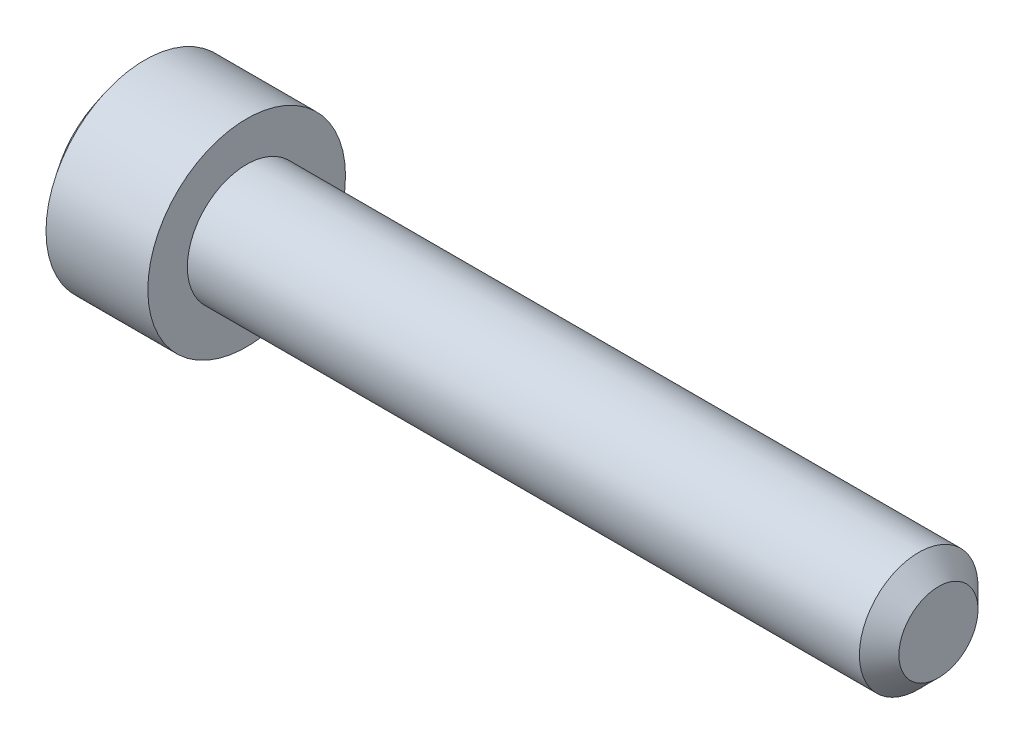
from build123d import *

# Parameters (mm, degrees)
ENL_V_MAT_EXTRU_1_DEPTH = 3


with BuildPart() as part:
    # Esquisse1 → Base-R_volution (revolve)
    with BuildSketch(Plane.XY, mode=Mode.PRIVATE) as base_r_volution_sk:
        Polygon((0, 0), (0, 3.86862915), (0.848528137, 5), (6, 5), (6, 3), (40, 3), (41, 2), (41, 0), align=None)
    revolve(base_r_volution_sk.sketch.rotate(Axis((-28.576196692, 0, 0), (1, 0, 0)), 90), axis=Axis((-28.576196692, 0, 0), (1, 0, 0)))

    # Esquisse2 → Enl_v. mat.-Extru.1 (cut)
    with BuildSketch(Plane(origin=(0, 5.465458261, -1.391437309), x_dir=(0, 0, 1), z_dir=(-1, 0, 0))):
        Polygon((-0.504565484, -7.659075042), (-1.508007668, -5.465458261), (-0.020287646, -2.932907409), (3.287440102, -3.271841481), (4.290882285, -5.465458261), (2.803162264, -7.998009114), align=None)
    extrude(amount=-ENL_V_MAT_EXTRU_1_DEPTH, mode=Mode.SUBTRACT)


solid = part.part
